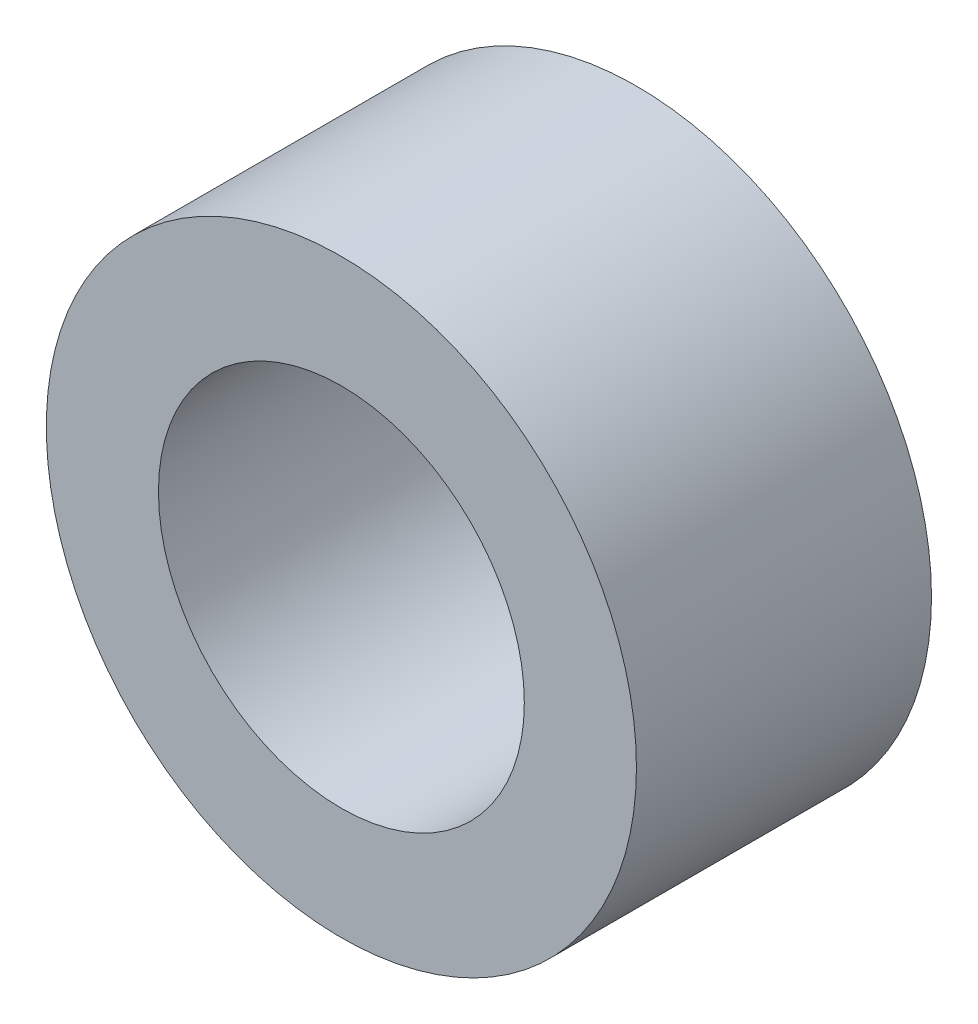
ISO-10303-21;
HEADER;
FILE_DESCRIPTION(('STEP AP214'),'2;1');
FILE_NAME('part.step','',(''),(''),'','','');
FILE_SCHEMA(('AUTOMOTIVE_DESIGN { 1 0 10303 214 1 1 1 1 }'));
ENDSEC;
DATA;
#1=APPLICATION_CONTEXT('core data for automotive mechanical design processes');
#2=APPLICATION_PROTOCOL_DEFINITION('international standard','automotive_design',2000,#1);
#3=PRODUCT_CONTEXT('',#1,'mechanical');
#4=PRODUCT('Part','Part','',(#3));
#5=PRODUCT_RELATED_PRODUCT_CATEGORY('part','',(#4));
#6=PRODUCT_DEFINITION_FORMATION('','',#4);
#7=PRODUCT_DEFINITION_CONTEXT('part definition',#1,'design');
#8=PRODUCT_DEFINITION('design','',#6,#7);
#9=PRODUCT_DEFINITION_SHAPE('','',#8);
#10=(LENGTH_UNIT() NAMED_UNIT(*) SI_UNIT(.MILLI.,.METRE.));
#11=(NAMED_UNIT(*) PLANE_ANGLE_UNIT() SI_UNIT($,.RADIAN.));
#12=(NAMED_UNIT(*) SI_UNIT($,.STERADIAN.) SOLID_ANGLE_UNIT());
#13=UNCERTAINTY_MEASURE_WITH_UNIT(LENGTH_MEASURE(1.E-05),#10,'distance_accuracy_value','');
#14=(GEOMETRIC_REPRESENTATION_CONTEXT(3) GLOBAL_UNCERTAINTY_ASSIGNED_CONTEXT((#13)) GLOBAL_UNIT_ASSIGNED_CONTEXT((#10,
#11,#12)) REPRESENTATION_CONTEXT('',''));
#15=CARTESIAN_POINT('',(0.,0.,0.));
#16=DIRECTION('',(0.,0.,1.));
#17=DIRECTION('',(1.,0.,0.));
#18=AXIS2_PLACEMENT_3D('',#15,#16,#17);
#19=CARTESIAN_POINT('',(0.,0.,-2.5));
#20=DIRECTION('',(0.,0.,1.));
#21=DIRECTION('',(1.,0.,0.));
#22=AXIS2_PLACEMENT_3D('',#19,#20,#21);
#23=CYLINDRICAL_SURFACE('',#22,5.);
#24=CARTESIAN_POINT('',(0.,0.,-2.5));
#25=DIRECTION('',(0.,0.,1.));
#26=DIRECTION('',(1.,0.,0.));
#27=AXIS2_PLACEMENT_3D('',#24,#25,#26);
#28=CIRCLE('',#27,5.);
#29=CARTESIAN_POINT('',(5.,0.,-2.5));
#30=VERTEX_POINT('',#29);
#31=EDGE_CURVE('E10',#30,#30,#28,.T.);
#32=ORIENTED_EDGE('',*,*,#31,.T.);
#33=EDGE_LOOP('',(#32));
#34=FACE_BOUND('',#33,.T.);
#35=CARTESIAN_POINT('',(0.,0.,2.5));
#36=DIRECTION('',(0.,0.,1.));
#37=DIRECTION('',(1.,0.,0.));
#38=AXIS2_PLACEMENT_3D('',#35,#36,#37);
#39=CIRCLE('',#38,5.);
#40=CARTESIAN_POINT('',(5.,0.,2.5));
#41=VERTEX_POINT('',#40);
#42=EDGE_CURVE('E42',#41,#41,#39,.T.);
#43=ORIENTED_EDGE('',*,*,#42,.F.);
#44=EDGE_LOOP('',(#43));
#45=FACE_BOUND('',#44,.T.);
#46=ADVANCED_FACE('F39',(#34,#45),#23,.T.);
#47=CARTESIAN_POINT('',(0.,0.,-2.5));
#48=DIRECTION('',(0.,0.,1.));
#49=DIRECTION('',(1.,0.,0.));
#50=AXIS2_PLACEMENT_3D('',#47,#48,#49);
#51=PLANE('',#50);
#52=CARTESIAN_POINT('',(0.,0.,-2.5));
#53=DIRECTION('',(0.,0.,1.));
#54=DIRECTION('',(1.,0.,0.));
#55=AXIS2_PLACEMENT_3D('',#52,#53,#54);
#56=CIRCLE('',#55,3.1);
#57=CARTESIAN_POINT('',(3.1,0.,-2.5));
#58=VERTEX_POINT('',#57);
#59=EDGE_CURVE('E49',#58,#58,#56,.T.);
#60=ORIENTED_EDGE('',*,*,#59,.T.);
#61=EDGE_LOOP('',(#60));
#62=FACE_BOUND('',#61,.T.);
#63=ORIENTED_EDGE('',*,*,#31,.F.);
#64=EDGE_LOOP('',(#63));
#65=FACE_BOUND('',#64,.T.);
#66=ADVANCED_FACE('F57',(#62,#65),#51,.F.);
#67=CARTESIAN_POINT('',(0.,0.,2.5));
#68=DIRECTION('',(0.,0.,1.));
#69=DIRECTION('',(1.,0.,0.));
#70=AXIS2_PLACEMENT_3D('',#67,#68,#69);
#71=PLANE('',#70);
#72=CARTESIAN_POINT('',(0.,0.,2.5));
#73=DIRECTION('',(0.,0.,1.));
#74=DIRECTION('',(1.,0.,0.));
#75=AXIS2_PLACEMENT_3D('',#72,#73,#74);
#76=CIRCLE('',#75,3.1);
#77=CARTESIAN_POINT('',(3.1,0.,2.5));
#78=VERTEX_POINT('',#77);
#79=EDGE_CURVE('E51',#78,#78,#76,.T.);
#80=ORIENTED_EDGE('',*,*,#79,.F.);
#81=EDGE_LOOP('',(#80));
#82=FACE_BOUND('',#81,.T.);
#83=ORIENTED_EDGE('',*,*,#42,.T.);
#84=EDGE_LOOP('',(#83));
#85=FACE_BOUND('',#84,.T.);
#86=ADVANCED_FACE('F63',(#82,#85),#71,.T.);
#87=CARTESIAN_POINT('',(0.,0.,-2.5));
#88=DIRECTION('',(0.,0.,1.));
#89=DIRECTION('',(1.,0.,0.));
#90=AXIS2_PLACEMENT_3D('',#87,#88,#89);
#91=CYLINDRICAL_SURFACE('',#90,3.1);
#92=ORIENTED_EDGE('',*,*,#59,.F.);
#93=EDGE_LOOP('',(#92));
#94=FACE_BOUND('',#93,.T.);
#95=ORIENTED_EDGE('',*,*,#79,.T.);
#96=EDGE_LOOP('',(#95));
#97=FACE_BOUND('',#96,.T.);
#98=ADVANCED_FACE('F60',(#94,#97),#91,.F.);
#99=CLOSED_SHELL('',(#46,#66,#86,#98));
#100=MANIFOLD_SOLID_BREP('B2',#99);
#101=ADVANCED_BREP_SHAPE_REPRESENTATION('',(#18,#100),#14);
#102=SHAPE_DEFINITION_REPRESENTATION(#9,#101);
ENDSEC;
END-ISO-10303-21;
